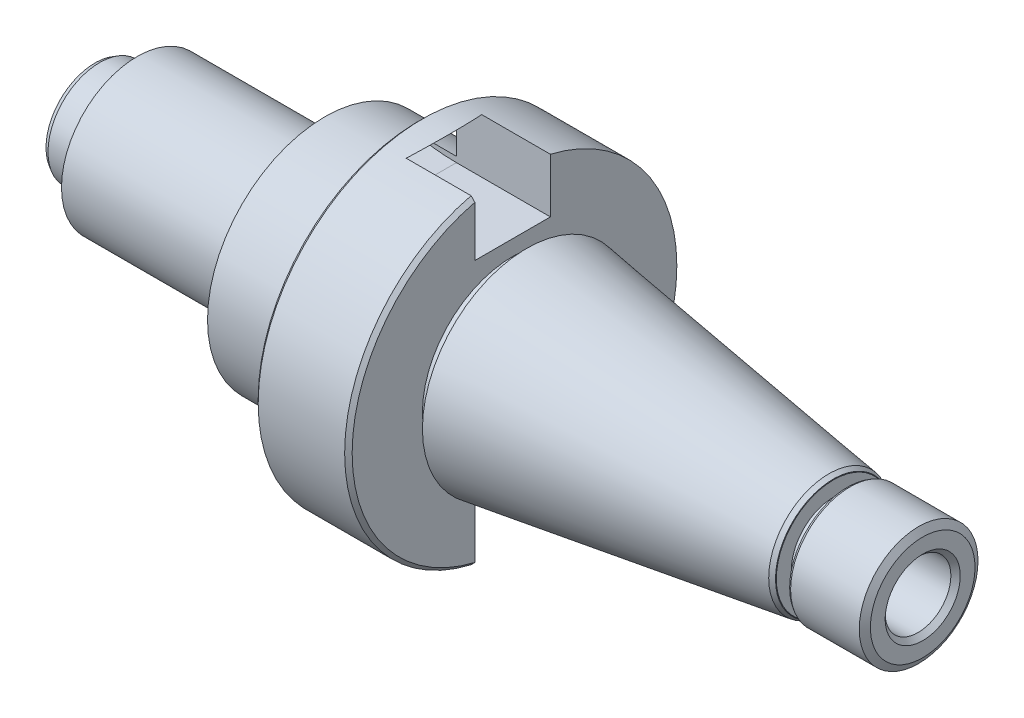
ISO-10303-21;
HEADER;
FILE_DESCRIPTION(('STEP AP214'),'2;1');
FILE_NAME('part.step','',(''),(''),'','','');
FILE_SCHEMA(('AUTOMOTIVE_DESIGN { 1 0 10303 214 1 1 1 1 }'));
ENDSEC;
DATA;
#1=APPLICATION_CONTEXT('core data for automotive mechanical design processes');
#2=APPLICATION_PROTOCOL_DEFINITION('international standard','automotive_design',2000,#1);
#3=PRODUCT_CONTEXT('',#1,'mechanical');
#4=PRODUCT('Part','Part','',(#3));
#5=PRODUCT_RELATED_PRODUCT_CATEGORY('part','',(#4));
#6=PRODUCT_DEFINITION_FORMATION('','',#4);
#7=PRODUCT_DEFINITION_CONTEXT('part definition',#1,'design');
#8=PRODUCT_DEFINITION('design','',#6,#7);
#9=PRODUCT_DEFINITION_SHAPE('','',#8);
#10=(LENGTH_UNIT() NAMED_UNIT(*) SI_UNIT(.MILLI.,.METRE.));
#11=(NAMED_UNIT(*) PLANE_ANGLE_UNIT() SI_UNIT($,.RADIAN.));
#12=(NAMED_UNIT(*) SI_UNIT($,.STERADIAN.) SOLID_ANGLE_UNIT());
#13=UNCERTAINTY_MEASURE_WITH_UNIT(LENGTH_MEASURE(1.E-05),#10,'distance_accuracy_value','');
#14=(GEOMETRIC_REPRESENTATION_CONTEXT(3) GLOBAL_UNCERTAINTY_ASSIGNED_CONTEXT((#13)) GLOBAL_UNIT_ASSIGNED_CONTEXT((#10,
#11,#12)) REPRESENTATION_CONTEXT('',''));
#15=CARTESIAN_POINT('',(0.,0.,0.));
#16=DIRECTION('',(0.,0.,1.));
#17=DIRECTION('',(1.,0.,0.));
#18=AXIS2_PLACEMENT_3D('',#15,#16,#17);
#19=CARTESIAN_POINT('',(-59.0241854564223,5.54189043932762,0.));
#20=DIRECTION('',(-1.,0.,0.));
#21=DIRECTION('',(0.,0.,1.));
#22=AXIS2_PLACEMENT_3D('',#19,#20,#21);
#23=PLANE('',#22);
#24=CARTESIAN_POINT('',(-59.0241854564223,0.,0.));
#25=DIRECTION('',(-1.,0.,0.));
#26=DIRECTION('',(0.,0.,1.));
#27=AXIS2_PLACEMENT_3D('',#24,#25,#26);
#28=CIRCLE('',#27,10.4226497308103);
#29=CARTESIAN_POINT('',(-59.0241854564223,0.,10.4226497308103));
#30=VERTEX_POINT('',#29);
#31=EDGE_CURVE('E292',#30,#30,#28,.T.);
#32=ORIENTED_EDGE('',*,*,#31,.T.);
#33=EDGE_LOOP('',(#32));
#34=FACE_BOUND('',#33,.T.);
#35=CARTESIAN_POINT('',(-59.0241854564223,0.,0.));
#36=DIRECTION('',(-1.,0.,0.));
#37=DIRECTION('',(0.,0.,1.));
#38=AXIS2_PLACEMENT_3D('',#35,#36,#37);
#39=CIRCLE('',#38,5.54189043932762);
#40=CARTESIAN_POINT('',(-59.0241854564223,0.,5.54189043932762));
#41=VERTEX_POINT('',#40);
#42=EDGE_CURVE('E234',#41,#41,#39,.T.);
#43=ORIENTED_EDGE('',*,*,#42,.F.);
#44=EDGE_LOOP('',(#43));
#45=FACE_BOUND('',#44,.T.);
#46=ADVANCED_FACE('F26',(#34,#45),#23,.T.);
#47=CARTESIAN_POINT('',(-30.,0.,0.));
#48=DIRECTION('',(-1.,0.,0.));
#49=DIRECTION('',(0.,0.,1.));
#50=AXIS2_PLACEMENT_3D('',#47,#48,#49);
#51=CYLINDRICAL_SURFACE('',#50,11.);
#52=CARTESIAN_POINT('',(-58.0241854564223,0.,0.));
#53=DIRECTION('',(-1.,0.,0.));
#54=DIRECTION('',(0.,0.,1.));
#55=AXIS2_PLACEMENT_3D('',#52,#53,#54);
#56=CIRCLE('',#55,11.);
#57=CARTESIAN_POINT('',(-58.0241854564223,0.,11.));
#58=VERTEX_POINT('',#57);
#59=EDGE_CURVE('E295',#58,#58,#56,.F.);
#60=ORIENTED_EDGE('',*,*,#59,.T.);
#61=EDGE_LOOP('',(#60));
#62=FACE_BOUND('',#61,.T.);
#63=CARTESIAN_POINT('',(-50.0241854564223,0.,0.));
#64=DIRECTION('',(-1.,0.,0.));
#65=DIRECTION('',(0.,0.,1.));
#66=AXIS2_PLACEMENT_3D('',#63,#64,#65);
#67=CIRCLE('',#66,11.);
#68=CARTESIAN_POINT('',(-50.0241854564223,0.,11.));
#69=VERTEX_POINT('',#68);
#70=EDGE_CURVE('E274',#69,#69,#67,.T.);
#71=ORIENTED_EDGE('',*,*,#70,.T.);
#72=EDGE_LOOP('',(#71));
#73=FACE_BOUND('',#72,.T.);
#74=ADVANCED_FACE('F379',(#62,#73),#51,.T.);
#75=CARTESIAN_POINT('',(-50.0241854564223,11.,0.));
#76=DIRECTION('',(-1.,0.,0.));
#77=DIRECTION('',(0.,0.,1.));
#78=AXIS2_PLACEMENT_3D('',#75,#76,#77);
#79=PLANE('',#78);
#80=CARTESIAN_POINT('',(-50.0241854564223,0.,0.));
#81=DIRECTION('',(-1.,0.,0.));
#82=DIRECTION('',(0.,0.,1.));
#83=AXIS2_PLACEMENT_3D('',#80,#81,#82);
#84=CIRCLE('',#83,16.1195276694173);
#85=CARTESIAN_POINT('',(-50.0241854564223,0.,16.1195276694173));
#86=VERTEX_POINT('',#85);
#87=EDGE_CURVE('E271',#86,#86,#84,.T.);
#88=ORIENTED_EDGE('',*,*,#87,.T.);
#89=EDGE_LOOP('',(#88));
#90=FACE_BOUND('',#89,.T.);
#91=ORIENTED_EDGE('',*,*,#70,.F.);
#92=EDGE_LOOP('',(#91));
#93=FACE_BOUND('',#92,.T.);
#94=ADVANCED_FACE('F385',(#90,#93),#79,.T.);
#95=CARTESIAN_POINT('',(-30.,0.,0.));
#96=DIRECTION('',(-1.,0.,0.));
#97=DIRECTION('',(0.,0.,1.));
#98=AXIS2_PLACEMENT_3D('',#95,#96,#97);
#99=CYLINDRICAL_SURFACE('',#98,16.1195276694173);
#100=ORIENTED_EDGE('',*,*,#87,.F.);
#101=EDGE_LOOP('',(#100));
#102=FACE_BOUND('',#101,.T.);
#103=CARTESIAN_POINT('',(-10.0241854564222,0.,0.));
#104=DIRECTION('',(-1.,0.,0.));
#105=DIRECTION('',(0.,0.,1.));
#106=AXIS2_PLACEMENT_3D('',#103,#104,#105);
#107=CIRCLE('',#106,16.1195276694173);
#108=CARTESIAN_POINT('',(-10.0241854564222,0.,16.1195276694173));
#109=VERTEX_POINT('',#108);
#110=EDGE_CURVE('E268',#109,#109,#107,.T.);
#111=ORIENTED_EDGE('',*,*,#110,.T.);
#112=EDGE_LOOP('',(#111));
#113=FACE_BOUND('',#112,.T.);
#114=ADVANCED_FACE('F464',(#102,#113),#99,.T.);
#115=CARTESIAN_POINT('',(-10.0241854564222,24.9999999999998,0.));
#116=DIRECTION('',(1.,0.,0.));
#117=DIRECTION('',(0.,0.,-1.));
#118=AXIS2_PLACEMENT_3D('',#115,#116,#117);
#119=PLANE('',#118);
#120=ORIENTED_EDGE('',*,*,#110,.F.);
#121=EDGE_LOOP('',(#120));
#122=FACE_BOUND('',#121,.T.);
#123=CARTESIAN_POINT('',(-10.0241854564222,0.,0.));
#124=DIRECTION('',(-1.,0.,0.));
#125=DIRECTION('',(0.,0.,1.));
#126=AXIS2_PLACEMENT_3D('',#123,#124,#125);
#127=CIRCLE('',#126,24.9999999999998);
#128=CARTESIAN_POINT('',(-10.0241854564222,0.,24.9999999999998));
#129=VERTEX_POINT('',#128);
#130=EDGE_CURVE('E265',#129,#129,#127,.T.);
#131=ORIENTED_EDGE('',*,*,#130,.T.);
#132=EDGE_LOOP('',(#131));
#133=FACE_BOUND('',#132,.T.);
#134=ADVANCED_FACE('F460',(#122,#133),#119,.F.);
#135=CARTESIAN_POINT('',(-30.,0.,0.));
#136=DIRECTION('',(-1.,0.,0.));
#137=DIRECTION('',(0.,0.,1.));
#138=AXIS2_PLACEMENT_3D('',#135,#136,#137);
#139=CYLINDRICAL_SURFACE('',#138,24.9999999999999);
#140=ORIENTED_EDGE('',*,*,#130,.F.);
#141=EDGE_LOOP('',(#140));
#142=FACE_BOUND('',#141,.T.);
#143=CARTESIAN_POINT('',(-24.6755664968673,0.,0.));
#144=DIRECTION('',(0.647903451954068,0.761722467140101,0.));
#145=DIRECTION('',(-0.761722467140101,0.647903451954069,0.));
#146=AXIS2_PLACEMENT_3D('',#143,#144,#145);
#147=ELLIPSE('',#146,38.5859959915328,24.9999999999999);
#148=CARTESIAN_POINT('',(3.15083548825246,-23.6684917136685,8.05000000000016));
#149=VERTEX_POINT('',#148);
#150=CARTESIAN_POINT('',(3.15083548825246,-23.6684917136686,-8.04999999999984));
#151=VERTEX_POINT('',#150);
#152=EDGE_CURVE('E187',#149,#151,#147,.T.);
#153=ORIENTED_EDGE('',*,*,#152,.F.);
#154=DIRECTION('',(-1.,0.,0.));
#155=VECTOR('',#154,1.);
#156=CARTESIAN_POINT('',(-30.,-23.6684917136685,8.05000000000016));
#157=LINE('',#156,#155);
#158=CARTESIAN_POINT('',(9.97581454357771,-23.6684917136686,8.05000000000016));
#159=VERTEX_POINT('',#158);
#160=EDGE_CURVE('E184',#149,#159,#157,.F.);
#161=ORIENTED_EDGE('',*,*,#160,.T.);
#162=CARTESIAN_POINT('',(9.97581454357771,0.,0.));
#163=DIRECTION('',(-1.,0.,0.));
#164=DIRECTION('',(0.,0.,1.));
#165=AXIS2_PLACEMENT_3D('',#162,#163,#164);
#166=CIRCLE('',#165,25.);
#167=CARTESIAN_POINT('',(9.97581454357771,23.6684917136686,8.05));
#168=VERTEX_POINT('',#167);
#169=EDGE_CURVE('E261',#159,#168,#166,.T.);
#170=ORIENTED_EDGE('',*,*,#169,.T.);
#171=DIRECTION('',(-1.,0.,0.));
#172=VECTOR('',#171,1.);
#173=CARTESIAN_POINT('',(-30.,23.6684917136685,8.05));
#174=LINE('',#173,#172);
#175=CARTESIAN_POINT('',(3.15083548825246,23.6684917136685,8.05));
#176=VERTEX_POINT('',#175);
#177=EDGE_CURVE('E219',#176,#168,#174,.F.);
#178=ORIENTED_EDGE('',*,*,#177,.F.);
#179=CARTESIAN_POINT('',(-24.6755664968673,0.,0.));
#180=DIRECTION('',(0.647903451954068,-0.761722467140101,0.));
#181=DIRECTION('',(-0.761722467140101,-0.647903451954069,0.));
#182=AXIS2_PLACEMENT_3D('',#179,#180,#181);
#183=ELLIPSE('',#182,38.5859959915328,24.9999999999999);
#184=CARTESIAN_POINT('',(3.15083548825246,23.6684917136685,-8.05));
#185=VERTEX_POINT('',#184);
#186=EDGE_CURVE('E232',#185,#176,#183,.T.);
#187=ORIENTED_EDGE('',*,*,#186,.F.);
#188=DIRECTION('',(-1.,0.,0.));
#189=VECTOR('',#188,1.);
#190=CARTESIAN_POINT('',(-30.,23.6684917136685,-8.05));
#191=LINE('',#190,#189);
#192=CARTESIAN_POINT('',(9.97581454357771,23.6684917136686,-8.05));
#193=VERTEX_POINT('',#192);
#194=EDGE_CURVE('E226',#185,#193,#191,.F.);
#195=ORIENTED_EDGE('',*,*,#194,.T.);
#196=CARTESIAN_POINT('',(9.97581454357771,-23.6684917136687,-8.04999999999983));
#197=VERTEX_POINT('',#196);
#198=EDGE_CURVE('E262',#193,#197,#166,.T.);
#199=ORIENTED_EDGE('',*,*,#198,.T.);
#200=DIRECTION('',(-1.,0.,0.));
#201=VECTOR('',#200,1.);
#202=CARTESIAN_POINT('',(-30.,-23.6684917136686,-8.04999999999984));
#203=LINE('',#202,#201);
#204=EDGE_CURVE('E159',#151,#197,#203,.F.);
#205=ORIENTED_EDGE('',*,*,#204,.F.);
#206=EDGE_LOOP('',(#153,#161,#170,#178,#187,#195,#199,#205));
#207=FACE_BOUND('',#206,.T.);
#208=ADVANCED_FACE('F456',(#142,#207),#139,.T.);
#209=CARTESIAN_POINT('',(9.97581454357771,25.,0.));
#210=DIRECTION('',(-1.,0.,0.));
#211=DIRECTION('',(0.,0.,1.));
#212=AXIS2_PLACEMENT_3D('',#209,#210,#211);
#213=PLANE('',#212);
#214=CARTESIAN_POINT('',(9.97581454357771,0.,0.));
#215=DIRECTION('',(-1.,0.,0.));
#216=DIRECTION('',(0.,0.,1.));
#217=AXIS2_PLACEMENT_3D('',#214,#215,#216);
#218=CIRCLE('',#217,34.2);
#219=CARTESIAN_POINT('',(9.97581454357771,0.,34.2));
#220=VERTEX_POINT('',#219);
#221=EDGE_CURVE('E313',#220,#220,#218,.T.);
#222=ORIENTED_EDGE('',*,*,#221,.T.);
#223=EDGE_LOOP('',(#222));
#224=FACE_BOUND('',#223,.T.);
#225=DIRECTION('',(0.,1.,0.));
#226=VECTOR('',#225,1.);
#227=CARTESIAN_POINT('',(9.97581454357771,-24.9999999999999,8.05000000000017));
#228=LINE('',#227,#226);
#229=CARTESIAN_POINT('',(9.97581454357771,-29.4736604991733,8.05000000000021));
#230=VERTEX_POINT('',#229);
#231=EDGE_CURVE('E175',#230,#159,#228,.T.);
#232=ORIENTED_EDGE('',*,*,#231,.F.);
#233=DIRECTION('',(0.,0.,-1.));
#234=VECTOR('',#233,1.);
#235=CARTESIAN_POINT('',(9.97581454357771,-29.4736604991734,2.05813590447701E-13));
#236=LINE('',#235,#234);
#237=CARTESIAN_POINT('',(9.97581454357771,-29.4736604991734,-8.04999999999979));
#238=VERTEX_POINT('',#237);
#239=EDGE_CURVE('E177',#230,#238,#236,.T.);
#240=ORIENTED_EDGE('',*,*,#239,.T.);
#241=DIRECTION('',(0.,1.,0.));
#242=VECTOR('',#241,1.);
#243=CARTESIAN_POINT('',(9.97581454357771,-25.,-8.04999999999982));
#244=LINE('',#243,#242);
#245=EDGE_CURVE('E509',#238,#197,#244,.T.);
#246=ORIENTED_EDGE('',*,*,#245,.T.);
#247=ORIENTED_EDGE('',*,*,#198,.F.);
#248=DIRECTION('',(0.,-1.,0.));
#249=VECTOR('',#248,1.);
#250=CARTESIAN_POINT('',(9.97581454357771,25.,-8.05));
#251=LINE('',#250,#249);
#252=CARTESIAN_POINT('',(9.97581454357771,29.4736604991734,-8.05));
#253=VERTEX_POINT('',#252);
#254=EDGE_CURVE('E224',#253,#193,#251,.T.);
#255=ORIENTED_EDGE('',*,*,#254,.F.);
#256=DIRECTION('',(0.,0.,1.));
#257=VECTOR('',#256,1.);
#258=CARTESIAN_POINT('',(9.97581454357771,29.4736604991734,0.));
#259=LINE('',#258,#257);
#260=CARTESIAN_POINT('',(9.97581454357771,29.4736604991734,8.05));
#261=VERTEX_POINT('',#260);
#262=EDGE_CURVE('E229',#253,#261,#259,.T.);
#263=ORIENTED_EDGE('',*,*,#262,.T.);
#264=DIRECTION('',(0.,-1.,0.));
#265=VECTOR('',#264,1.);
#266=CARTESIAN_POINT('',(9.97581454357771,25.,8.05));
#267=LINE('',#266,#265);
#268=EDGE_CURVE('E216',#261,#168,#267,.T.);
#269=ORIENTED_EDGE('',*,*,#268,.T.);
#270=ORIENTED_EDGE('',*,*,#169,.F.);
#271=EDGE_LOOP('',(#232,#240,#246,#247,#255,#263,#269,#270));
#272=FACE_BOUND('',#271,.T.);
#273=ADVANCED_FACE('F453',(#224,#272),#213,.T.);
#274=CARTESIAN_POINT('',(-30.,0.,0.));
#275=DIRECTION('',(-1.,0.,0.));
#276=DIRECTION('',(0.,0.,1.));
#277=AXIS2_PLACEMENT_3D('',#274,#275,#276);
#278=CYLINDRICAL_SURFACE('',#277,35.);
#279=CARTESIAN_POINT('',(10.7758145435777,0.,0.));
#280=DIRECTION('',(-1.,0.,0.));
#281=DIRECTION('',(0.,0.,1.));
#282=AXIS2_PLACEMENT_3D('',#279,#280,#281);
#283=CIRCLE('',#282,35.);
#284=CARTESIAN_POINT('',(10.7758145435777,0.,35.));
#285=VERTEX_POINT('',#284);
#286=EDGE_CURVE('E319',#285,#285,#283,.F.);
#287=ORIENTED_EDGE('',*,*,#286,.T.);
#288=EDGE_LOOP('',(#287));
#289=FACE_BOUND('',#288,.T.);
#290=DIRECTION('',(-1.,0.,0.));
#291=VECTOR('',#290,1.);
#292=CARTESIAN_POINT('',(-30.,-34.0616720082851,8.05000000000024));
#293=LINE('',#292,#291);
#294=CARTESIAN_POINT('',(29.2,-34.0616720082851,8.05000000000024));
#295=VERTEX_POINT('',#294);
#296=CARTESIAN_POINT('',(15.3698148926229,-34.0616720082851,8.05000000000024));
#297=VERTEX_POINT('',#296);
#298=EDGE_CURVE('E172',#295,#297,#293,.T.);
#299=ORIENTED_EDGE('',*,*,#298,.F.);
#300=CARTESIAN_POINT('',(29.2,0.,0.));
#301=DIRECTION('',(1.,0.,0.));
#302=DIRECTION('',(0.,0.,-1.));
#303=AXIS2_PLACEMENT_3D('',#300,#301,#302);
#304=CIRCLE('',#303,35.);
#305=CARTESIAN_POINT('',(29.2,34.0616720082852,8.05));
#306=VERTEX_POINT('',#305);
#307=EDGE_CURVE('E316',#295,#306,#304,.F.);
#308=ORIENTED_EDGE('',*,*,#307,.T.);
#309=DIRECTION('',(-1.,0.,0.));
#310=VECTOR('',#309,1.);
#311=CARTESIAN_POINT('',(-30.,34.0616720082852,8.05));
#312=LINE('',#311,#310);
#313=CARTESIAN_POINT('',(15.3698148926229,34.0616720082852,8.05));
#314=VERTEX_POINT('',#313);
#315=EDGE_CURVE('E214',#306,#314,#312,.T.);
#316=ORIENTED_EDGE('',*,*,#315,.T.);
#317=CARTESIAN_POINT('',(-24.6755664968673,0.,0.));
#318=DIRECTION('',(0.647903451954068,-0.761722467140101,0.));
#319=DIRECTION('',(-0.761722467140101,-0.647903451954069,0.));
#320=AXIS2_PLACEMENT_3D('',#317,#318,#319);
#321=ELLIPSE('',#320,54.020394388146,35.);
#322=CARTESIAN_POINT('',(15.3698148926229,34.0616720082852,-8.05));
#323=VERTEX_POINT('',#322);
#324=EDGE_CURVE('E304',#314,#323,#321,.F.);
#325=ORIENTED_EDGE('',*,*,#324,.T.);
#326=DIRECTION('',(-1.,0.,0.));
#327=VECTOR('',#326,1.);
#328=CARTESIAN_POINT('',(-30.,34.0616720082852,-8.05));
#329=LINE('',#328,#327);
#330=CARTESIAN_POINT('',(30.,34.0616720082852,-8.05));
#331=VERTEX_POINT('',#330);
#332=EDGE_CURVE('E222',#331,#323,#329,.T.);
#333=ORIENTED_EDGE('',*,*,#332,.F.);
#334=CARTESIAN_POINT('',(30.,0.,0.));
#335=DIRECTION('',(-1.,0.,0.));
#336=DIRECTION('',(0.,0.,1.));
#337=AXIS2_PLACEMENT_3D('',#334,#335,#336);
#338=CIRCLE('',#337,35.);
#339=CARTESIAN_POINT('',(30.,-34.0616720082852,-8.04999999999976));
#340=VERTEX_POINT('',#339);
#341=EDGE_CURVE('E258',#331,#340,#338,.T.);
#342=ORIENTED_EDGE('',*,*,#341,.T.);
#343=DIRECTION('',(-1.,0.,0.));
#344=VECTOR('',#343,1.);
#345=CARTESIAN_POINT('',(-30.,-34.0616720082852,-8.04999999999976));
#346=LINE('',#345,#344);
#347=CARTESIAN_POINT('',(15.3698148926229,-34.0616720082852,-8.04999999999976));
#348=VERTEX_POINT('',#347);
#349=EDGE_CURVE('E514',#340,#348,#346,.T.);
#350=ORIENTED_EDGE('',*,*,#349,.T.);
#351=CARTESIAN_POINT('',(-24.6755664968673,0.,0.));
#352=DIRECTION('',(0.647903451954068,0.761722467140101,0.));
#353=DIRECTION('',(-0.761722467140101,0.647903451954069,0.));
#354=AXIS2_PLACEMENT_3D('',#351,#352,#353);
#355=ELLIPSE('',#354,54.020394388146,35.);
#356=EDGE_CURVE('E523',#348,#297,#355,.F.);
#357=ORIENTED_EDGE('',*,*,#356,.T.);
#358=EDGE_LOOP('',(#299,#308,#316,#325,#333,#342,#350,#357));
#359=FACE_BOUND('',#358,.T.);
#360=ADVANCED_FACE('F450',(#289,#359),#278,.T.);
#361=CARTESIAN_POINT('',(30.,35.,0.));
#362=DIRECTION('',(1.,0.,0.));
#363=DIRECTION('',(0.,0.,-1.));
#364=AXIS2_PLACEMENT_3D('',#361,#362,#363);
#365=PLANE('',#364);
#366=DIRECTION('',(0.,1.,0.));
#367=VECTOR('',#366,1.);
#368=CARTESIAN_POINT('',(30.,35.,8.05));
#369=LINE('',#368,#367);
#370=CARTESIAN_POINT('',(30.,22.5,8.05));
#371=VERTEX_POINT('',#370);
#372=CARTESIAN_POINT('',(30.,33.2390959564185,8.05));
#373=VERTEX_POINT('',#372);
#374=EDGE_CURVE('E298',#371,#373,#369,.T.);
#375=ORIENTED_EDGE('',*,*,#374,.T.);
#376=CARTESIAN_POINT('',(30.,0.,0.));
#377=DIRECTION('',(1.,0.,0.));
#378=DIRECTION('',(0.,0.,-1.));
#379=AXIS2_PLACEMENT_3D('',#376,#377,#378);
#380=CIRCLE('',#379,34.2);
#381=CARTESIAN_POINT('',(30.,-33.2390959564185,8.05000000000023));
#382=VERTEX_POINT('',#381);
#383=EDGE_CURVE('E40',#373,#382,#380,.T.);
#384=ORIENTED_EDGE('',*,*,#383,.T.);
#385=DIRECTION('',(0.,-1.,0.));
#386=VECTOR('',#385,1.);
#387=CARTESIAN_POINT('',(30.,-34.9999999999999,8.05000000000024));
#388=LINE('',#387,#386);
#389=CARTESIAN_POINT('',(30.,-22.4999999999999,8.05000000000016));
#390=VERTEX_POINT('',#389);
#391=EDGE_CURVE('E164',#390,#382,#388,.T.);
#392=ORIENTED_EDGE('',*,*,#391,.F.);
#393=DIRECTION('',(0.,0.,1.));
#394=VECTOR('',#393,1.);
#395=CARTESIAN_POINT('',(30.,-22.5,1.57116751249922E-13));
#396=LINE('',#395,#394);
#397=CARTESIAN_POINT('',(30.,-22.5000000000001,-8.04999999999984));
#398=VERTEX_POINT('',#397);
#399=EDGE_CURVE('E151',#398,#390,#396,.T.);
#400=ORIENTED_EDGE('',*,*,#399,.F.);
#401=DIRECTION('',(0.,-1.,0.));
#402=VECTOR('',#401,1.);
#403=CARTESIAN_POINT('',(30.,-35.,-8.04999999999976));
#404=LINE('',#403,#402);
#405=EDGE_CURVE('E522',#398,#340,#404,.T.);
#406=ORIENTED_EDGE('',*,*,#405,.T.);
#407=ORIENTED_EDGE('',*,*,#341,.F.);
#408=DIRECTION('',(0.,1.,0.));
#409=VECTOR('',#408,1.);
#410=CARTESIAN_POINT('',(30.,35.,-8.05));
#411=LINE('',#410,#409);
#412=CARTESIAN_POINT('',(30.,22.5,-8.05));
#413=VERTEX_POINT('',#412);
#414=EDGE_CURVE('E302',#413,#331,#411,.T.);
#415=ORIENTED_EDGE('',*,*,#414,.F.);
#416=DIRECTION('',(0.,0.,-1.));
#417=VECTOR('',#416,1.);
#418=CARTESIAN_POINT('',(30.,22.5,0.));
#419=LINE('',#418,#417);
#420=EDGE_CURVE('E300',#371,#413,#419,.T.);
#421=ORIENTED_EDGE('',*,*,#420,.F.);
#422=EDGE_LOOP('',(#375,#384,#392,#400,#406,#407,#415,#421));
#423=FACE_BOUND('',#422,.T.);
#424=CARTESIAN_POINT('',(30.,0.,0.));
#425=DIRECTION('',(-1.,0.,0.));
#426=DIRECTION('',(0.,0.,1.));
#427=AXIS2_PLACEMENT_3D('',#424,#425,#426);
#428=CIRCLE('',#427,19.225);
#429=CARTESIAN_POINT('',(30.,0.,19.225));
#430=VERTEX_POINT('',#429);
#431=EDGE_CURVE('E255',#430,#430,#428,.T.);
#432=ORIENTED_EDGE('',*,*,#431,.T.);
#433=EDGE_LOOP('',(#432));
#434=FACE_BOUND('',#433,.T.);
#435=ADVANCED_FACE('F170',(#423,#434),#365,.T.);
#436=CARTESIAN_POINT('',(-30.,0.,0.));
#437=DIRECTION('',(-1.,0.,0.));
#438=DIRECTION('',(0.,0.,1.));
#439=AXIS2_PLACEMENT_3D('',#436,#437,#438);
#440=CYLINDRICAL_SURFACE('',#439,19.225);
#441=ORIENTED_EDGE('',*,*,#431,.F.);
#442=EDGE_LOOP('',(#441));
#443=FACE_BOUND('',#442,.T.);
#444=CARTESIAN_POINT('',(33.,0.,0.));
#445=DIRECTION('',(-1.,0.,0.));
#446=DIRECTION('',(0.,0.,1.));
#447=AXIS2_PLACEMENT_3D('',#444,#445,#446);
#448=CIRCLE('',#447,19.225);
#449=CARTESIAN_POINT('',(33.,0.,19.225));
#450=VERTEX_POINT('',#449);
#451=EDGE_CURVE('E252',#450,#450,#448,.T.);
#452=ORIENTED_EDGE('',*,*,#451,.T.);
#453=EDGE_LOOP('',(#452));
#454=FACE_BOUND('',#453,.T.);
#455=ADVANCED_FACE('F443',(#443,#454),#440,.T.);
#456=CARTESIAN_POINT('',(33.,22.225,0.));
#457=DIRECTION('',(1.,0.,0.));
#458=DIRECTION('',(0.,0.,-1.));
#459=AXIS2_PLACEMENT_3D('',#456,#457,#458);
#460=PLANE('',#459);
#461=ORIENTED_EDGE('',*,*,#451,.F.);
#462=EDGE_LOOP('',(#461));
#463=FACE_BOUND('',#462,.T.);
#464=CARTESIAN_POINT('',(33.,0.,0.));
#465=DIRECTION('',(-1.,0.,0.));
#466=DIRECTION('',(0.,0.,1.));
#467=AXIS2_PLACEMENT_3D('',#464,#465,#466);
#468=CIRCLE('',#467,22.225);
#469=CARTESIAN_POINT('',(33.,0.,22.225));
#470=VERTEX_POINT('',#469);
#471=EDGE_CURVE('E249',#470,#470,#468,.T.);
#472=ORIENTED_EDGE('',*,*,#471,.T.);
#473=EDGE_LOOP('',(#472));
#474=FACE_BOUND('',#473,.T.);
#475=ADVANCED_FACE('F439',(#463,#474),#460,.F.);
#476=CARTESIAN_POINT('',(33.,0.,0.));
#477=DIRECTION('',(-1.,0.,0.));
#478=DIRECTION('',(0.,0.,1.));
#479=AXIS2_PLACEMENT_3D('',#476,#477,#478);
#480=CONICAL_SURFACE('',#479,22.225,0.144687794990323);
#481=CARTESIAN_POINT('',(97.4160298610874,0.,0.));
#482=DIRECTION('',(1.,0.,0.));
#483=DIRECTION('',(0.,0.,-1.));
#484=AXIS2_PLACEMENT_3D('',#481,#482,#483);
#485=CIRCLE('',#484,12.8391992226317);
#486=CARTESIAN_POINT('',(97.4160298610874,0.,12.8391992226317));
#487=VERTEX_POINT('',#486);
#488=EDGE_CURVE('E307',#487,#487,#485,.F.);
#489=ORIENTED_EDGE('',*,*,#488,.T.);
#490=EDGE_LOOP('',(#489));
#491=FACE_BOUND('',#490,.T.);
#492=ORIENTED_EDGE('',*,*,#471,.F.);
#493=EDGE_LOOP('',(#492));
#494=FACE_BOUND('',#493,.T.);
#495=ADVANCED_FACE('F435',(#491,#494),#480,.T.);
#496=CARTESIAN_POINT('',(98.4,12.6958288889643,0.));
#497=DIRECTION('',(1.,0.,0.));
#498=DIRECTION('',(0.,0.,-1.));
#499=AXIS2_PLACEMENT_3D('',#496,#497,#498);
#500=PLANE('',#499);
#501=CARTESIAN_POINT('',(98.4,0.,0.));
#502=DIRECTION('',(1.,0.,0.));
#503=DIRECTION('',(0.,0.,-1.));
#504=AXIS2_PLACEMENT_3D('',#501,#502,#503);
#505=CIRCLE('',#504,12.1958288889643);
#506=CARTESIAN_POINT('',(98.4,0.,-12.1958288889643));
#507=VERTEX_POINT('',#506);
#508=EDGE_CURVE('E289',#507,#507,#505,.T.);
#509=ORIENTED_EDGE('',*,*,#508,.T.);
#510=EDGE_LOOP('',(#509));
#511=FACE_BOUND('',#510,.T.);
#512=CARTESIAN_POINT('',(98.4,0.,0.));
#513=DIRECTION('',(-1.,0.,0.));
#514=DIRECTION('',(0.,0.,1.));
#515=AXIS2_PLACEMENT_3D('',#512,#513,#514);
#516=CIRCLE('',#515,8.99999999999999);
#517=CARTESIAN_POINT('',(98.4,0.,8.99999999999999));
#518=VERTEX_POINT('',#517);
#519=EDGE_CURVE('E246',#518,#518,#516,.T.);
#520=ORIENTED_EDGE('',*,*,#519,.T.);
#521=EDGE_LOOP('',(#520));
#522=FACE_BOUND('',#521,.T.);
#523=ADVANCED_FACE('F432',(#511,#522),#500,.T.);
#524=CARTESIAN_POINT('',(-30.,0.,0.));
#525=DIRECTION('',(-1.,0.,0.));
#526=DIRECTION('',(0.,0.,1.));
#527=AXIS2_PLACEMENT_3D('',#524,#525,#526);
#528=CYLINDRICAL_SURFACE('',#527,8.99999999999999);
#529=CARTESIAN_POINT('',(101.4,0.,0.));
#530=DIRECTION('',(-1.,0.,0.));
#531=DIRECTION('',(0.,0.,1.));
#532=AXIS2_PLACEMENT_3D('',#529,#530,#531);
#533=CIRCLE('',#532,8.99999999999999);
#534=CARTESIAN_POINT('',(101.4,0.,8.99999999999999));
#535=VERTEX_POINT('',#534);
#536=EDGE_CURVE('E243',#535,#535,#533,.T.);
#537=ORIENTED_EDGE('',*,*,#536,.T.);
#538=EDGE_LOOP('',(#537));
#539=FACE_BOUND('',#538,.T.);
#540=ORIENTED_EDGE('',*,*,#519,.F.);
#541=EDGE_LOOP('',(#540));
#542=FACE_BOUND('',#541,.T.);
#543=ADVANCED_FACE('F428',(#539,#542),#528,.T.);
#544=CARTESIAN_POINT('',(101.4,8.99999999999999,0.));
#545=DIRECTION('',(-1.,0.,0.));
#546=DIRECTION('',(0.,0.,1.));
#547=AXIS2_PLACEMENT_3D('',#544,#545,#546);
#548=PLANE('',#547);
#549=CARTESIAN_POINT('',(101.4,0.,0.));
#550=DIRECTION('',(-1.,0.,0.));
#551=DIRECTION('',(0.,0.,1.));
#552=AXIS2_PLACEMENT_3D('',#549,#550,#551);
#553=CIRCLE('',#552,12.3613248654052);
#554=CARTESIAN_POINT('',(101.4,0.,12.3613248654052));
#555=VERTEX_POINT('',#554);
#556=EDGE_CURVE('E283',#555,#555,#553,.T.);
#557=ORIENTED_EDGE('',*,*,#556,.T.);
#558=EDGE_LOOP('',(#557));
#559=FACE_BOUND('',#558,.T.);
#560=ORIENTED_EDGE('',*,*,#536,.F.);
#561=EDGE_LOOP('',(#560));
#562=FACE_BOUND('',#561,.T.);
#563=ADVANCED_FACE('F424',(#559,#562),#548,.T.);
#564=CARTESIAN_POINT('',(-30.,0.,0.));
#565=DIRECTION('',(-1.,0.,0.));
#566=DIRECTION('',(0.,0.,1.));
#567=AXIS2_PLACEMENT_3D('',#564,#565,#566);
#568=CYLINDRICAL_SURFACE('',#567,12.65);
#569=CARTESIAN_POINT('',(101.9,0.,0.));
#570=DIRECTION('',(-1.,0.,0.));
#571=DIRECTION('',(0.,0.,1.));
#572=AXIS2_PLACEMENT_3D('',#569,#570,#571);
#573=CIRCLE('',#572,12.65);
#574=CARTESIAN_POINT('',(101.9,0.,12.65));
#575=VERTEX_POINT('',#574);
#576=EDGE_CURVE('E286',#575,#575,#573,.F.);
#577=ORIENTED_EDGE('',*,*,#576,.T.);
#578=EDGE_LOOP('',(#577));
#579=FACE_BOUND('',#578,.T.);
#580=CARTESIAN_POINT('',(116.533974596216,0.,0.));
#581=DIRECTION('',(1.,0.,0.));
#582=DIRECTION('',(0.,0.,-1.));
#583=AXIS2_PLACEMENT_3D('',#580,#581,#582);
#584=CIRCLE('',#583,12.65);
#585=CARTESIAN_POINT('',(116.533974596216,0.,-12.65));
#586=VERTEX_POINT('',#585);
#587=EDGE_CURVE('E277',#586,#586,#584,.F.);
#588=ORIENTED_EDGE('',*,*,#587,.T.);
#589=EDGE_LOOP('',(#588));
#590=FACE_BOUND('',#589,.T.);
#591=ADVANCED_FACE('F420',(#579,#590),#568,.T.);
#592=CARTESIAN_POINT('',(117.4,12.65,0.));
#593=DIRECTION('',(1.,0.,0.));
#594=DIRECTION('',(0.,0.,-1.));
#595=AXIS2_PLACEMENT_3D('',#592,#593,#594);
#596=PLANE('',#595);
#597=CARTESIAN_POINT('',(117.4,0.,0.));
#598=DIRECTION('',(1.,0.,0.));
#599=DIRECTION('',(0.,0.,-1.));
#600=AXIS2_PLACEMENT_3D('',#597,#598,#599);
#601=CIRCLE('',#600,8.00000000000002);
#602=CARTESIAN_POINT('',(117.4,0.,-8.00000000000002));
#603=VERTEX_POINT('',#602);
#604=EDGE_CURVE('E33',#603,#603,#601,.F.);
#605=ORIENTED_EDGE('',*,*,#604,.T.);
#606=EDGE_LOOP('',(#605));
#607=FACE_BOUND('',#606,.T.);
#608=CARTESIAN_POINT('',(117.4,0.,0.));
#609=DIRECTION('',(1.,0.,0.));
#610=DIRECTION('',(0.,0.,-1.));
#611=AXIS2_PLACEMENT_3D('',#608,#609,#610);
#612=CIRCLE('',#611,11.15);
#613=CARTESIAN_POINT('',(117.4,0.,-11.15));
#614=VERTEX_POINT('',#613);
#615=EDGE_CURVE('E280',#614,#614,#612,.T.);
#616=ORIENTED_EDGE('',*,*,#615,.T.);
#617=EDGE_LOOP('',(#616));
#618=FACE_BOUND('',#617,.T.);
#619=ADVANCED_FACE('F416',(#607,#618),#596,.T.);
#620=CARTESIAN_POINT('',(-30.,0.,0.));
#621=DIRECTION('',(-1.,0.,0.));
#622=DIRECTION('',(0.,0.,1.));
#623=AXIS2_PLACEMENT_3D('',#620,#621,#622);
#624=CYLINDRICAL_SURFACE('',#623,6.99999999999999);
#625=CARTESIAN_POINT('',(116.4,0.,0.));
#626=DIRECTION('',(1.,0.,0.));
#627=DIRECTION('',(0.,0.,-1.));
#628=AXIS2_PLACEMENT_3D('',#625,#626,#627);
#629=CIRCLE('',#628,6.99999999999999);
#630=CARTESIAN_POINT('',(116.4,0.,-6.99999999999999));
#631=VERTEX_POINT('',#630);
#632=EDGE_CURVE('E11',#631,#631,#629,.T.);
#633=ORIENTED_EDGE('',*,*,#632,.T.);
#634=EDGE_LOOP('',(#633));
#635=FACE_BOUND('',#634,.T.);
#636=CARTESIAN_POINT('',(59.0414518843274,0.,0.));
#637=DIRECTION('',(-1.,0.,0.));
#638=DIRECTION('',(0.,0.,1.));
#639=AXIS2_PLACEMENT_3D('',#636,#637,#638);
#640=CIRCLE('',#639,6.99999999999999);
#641=CARTESIAN_POINT('',(59.0414518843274,0.,6.99999999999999));
#642=VERTEX_POINT('',#641);
#643=EDGE_CURVE('E240',#642,#642,#640,.T.);
#644=ORIENTED_EDGE('',*,*,#643,.T.);
#645=EDGE_LOOP('',(#644));
#646=FACE_BOUND('',#645,.T.);
#647=ADVANCED_FACE('F412',(#635,#646),#624,.F.);
#648=CARTESIAN_POINT('',(59.0414518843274,0.,0.));
#649=DIRECTION('',(1.,0.,0.));
#650=DIRECTION('',(0.,0.,-1.));
#651=AXIS2_PLACEMENT_3D('',#648,#649,#650);
#652=CONICAL_SURFACE('',#651,6.99999999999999,1.0471975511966);
#653=CARTESIAN_POINT('',(55.,0.,0.));
#654=VERTEX_POINT('',#653);
#655=VERTEX_LOOP('',#654);
#656=FACE_BOUND('',#655,.T.);
#657=ORIENTED_EDGE('',*,*,#643,.F.);
#658=EDGE_LOOP('',(#657));
#659=FACE_BOUND('',#658,.T.);
#660=ADVANCED_FACE('F404',(#656,#659),#652,.F.);
#661=CARTESIAN_POINT('',(20.9758145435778,0.,0.));
#662=DIRECTION('',(-1.,0.,0.));
#663=DIRECTION('',(0.,0.,1.));
#664=AXIS2_PLACEMENT_3D('',#661,#662,#663);
#665=CONICAL_SURFACE('',#664,5.54189043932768,1.04719755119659);
#666=CARTESIAN_POINT('',(24.1754264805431,0.,0.));
#667=VERTEX_POINT('',#666);
#668=VERTEX_LOOP('',#667);
#669=FACE_BOUND('',#668,.T.);
#670=CARTESIAN_POINT('',(20.9758145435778,0.,0.));
#671=DIRECTION('',(-1.,0.,0.));
#672=DIRECTION('',(0.,0.,1.));
#673=AXIS2_PLACEMENT_3D('',#670,#671,#672);
#674=CIRCLE('',#673,5.54189043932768);
#675=CARTESIAN_POINT('',(20.9758145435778,0.,5.54189043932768));
#676=VERTEX_POINT('',#675);
#677=EDGE_CURVE('E237',#676,#676,#674,.T.);
#678=ORIENTED_EDGE('',*,*,#677,.T.);
#679=EDGE_LOOP('',(#678));
#680=FACE_BOUND('',#679,.T.);
#681=ADVANCED_FACE('F394',(#669,#680),#665,.F.);
#682=CARTESIAN_POINT('',(-30.,0.,0.));
#683=DIRECTION('',(-1.,0.,0.));
#684=DIRECTION('',(0.,0.,1.));
#685=AXIS2_PLACEMENT_3D('',#682,#683,#684);
#686=CYLINDRICAL_SURFACE('',#685,5.54189043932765);
#687=ORIENTED_EDGE('',*,*,#677,.F.);
#688=EDGE_LOOP('',(#687));
#689=FACE_BOUND('',#688,.T.);
#690=ORIENTED_EDGE('',*,*,#42,.T.);
#691=EDGE_LOOP('',(#690));
#692=FACE_BOUND('',#691,.T.);
#693=ADVANCED_FACE('F391',(#689,#692),#686,.F.);
#694=CARTESIAN_POINT('',(116.533974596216,0.,0.));
#695=DIRECTION('',(-1.,0.,0.));
#696=DIRECTION('',(0.,0.,1.));
#697=AXIS2_PLACEMENT_3D('',#694,#695,#696);
#698=CONICAL_SURFACE('',#697,12.65,1.0471975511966);
#699=ORIENTED_EDGE('',*,*,#615,.F.);
#700=EDGE_LOOP('',(#699));
#701=FACE_BOUND('',#700,.T.);
#702=ORIENTED_EDGE('',*,*,#587,.F.);
#703=EDGE_LOOP('',(#702));
#704=FACE_BOUND('',#703,.T.);
#705=ADVANCED_FACE('F393',(#701,#704),#698,.T.);
#706=CARTESIAN_POINT('',(101.4,0.,0.));
#707=DIRECTION('',(1.,0.,0.));
#708=DIRECTION('',(0.,0.,-1.));
#709=AXIS2_PLACEMENT_3D('',#706,#707,#708);
#710=CONICAL_SURFACE('',#709,12.3613248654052,0.523598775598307);
#711=ORIENTED_EDGE('',*,*,#576,.F.);
#712=EDGE_LOOP('',(#711));
#713=FACE_BOUND('',#712,.T.);
#714=ORIENTED_EDGE('',*,*,#556,.F.);
#715=EDGE_LOOP('',(#714));
#716=FACE_BOUND('',#715,.T.);
#717=ADVANCED_FACE('F401',(#713,#716),#710,.T.);
#718=CARTESIAN_POINT('',(98.084810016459,0.,0.));
#719=DIRECTION('',(-1.,0.,0.));
#720=DIRECTION('',(0.,0.,1.));
#721=AXIS2_PLACEMENT_3D('',#718,#719,#720);
#722=CONICAL_SURFACE('',#721,12.741753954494,1.04719755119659);
#723=CARTESIAN_POINT('',(98.334810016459,0.,0.));
#724=DIRECTION('',(1.,0.,0.));
#725=DIRECTION('',(0.,0.,-1.));
#726=AXIS2_PLACEMENT_3D('',#723,#724,#725);
#727=CIRCLE('',#726,12.3087412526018);
#728=CARTESIAN_POINT('',(98.334810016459,0.,12.3087412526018));
#729=VERTEX_POINT('',#728);
#730=EDGE_CURVE('E310',#729,#729,#727,.T.);
#731=ORIENTED_EDGE('',*,*,#730,.T.);
#732=EDGE_LOOP('',(#731));
#733=FACE_BOUND('',#732,.T.);
#734=ORIENTED_EDGE('',*,*,#508,.F.);
#735=EDGE_LOOP('',(#734));
#736=FACE_BOUND('',#735,.T.);
#737=ADVANCED_FACE('F555',(#733,#736),#722,.T.);
#738=CARTESIAN_POINT('',(-59.0241854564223,0.,0.));
#739=DIRECTION('',(1.,0.,0.));
#740=DIRECTION('',(0.,0.,-1.));
#741=AXIS2_PLACEMENT_3D('',#738,#739,#740);
#742=CONICAL_SURFACE('',#741,10.4226497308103,0.523598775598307);
#743=ORIENTED_EDGE('',*,*,#59,.F.);
#744=EDGE_LOOP('',(#743));
#745=FACE_BOUND('',#744,.T.);
#746=ORIENTED_EDGE('',*,*,#31,.F.);
#747=EDGE_LOOP('',(#746));
#748=FACE_BOUND('',#747,.T.);
#749=ADVANCED_FACE('F550',(#745,#748),#742,.T.);
#750=CARTESIAN_POINT('',(2.58646928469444,23.1884549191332,-8.05));
#751=DIRECTION('',(0.647903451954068,-0.761722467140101,0.));
#752=DIRECTION('',(0.761722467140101,0.647903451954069,0.));
#753=AXIS2_PLACEMENT_3D('',#750,#751,#752);
#754=PLANE('',#753);
#755=ORIENTED_EDGE('',*,*,#186,.T.);
#756=DIRECTION('',(0.761722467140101,0.647903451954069,0.));
#757=VECTOR('',#756,1.);
#758=CARTESIAN_POINT('',(2.58646928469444,23.1884549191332,8.05));
#759=LINE('',#758,#757);
#760=CARTESIAN_POINT('',(2.58646928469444,23.1884549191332,8.05));
#761=VERTEX_POINT('',#760);
#762=EDGE_CURVE('E194',#761,#176,#759,.T.);
#763=ORIENTED_EDGE('',*,*,#762,.F.);
#764=DIRECTION('',(0.,0.,1.));
#765=VECTOR('',#764,1.);
#766=CARTESIAN_POINT('',(2.58646928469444,23.1884549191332,-8.05));
#767=LINE('',#766,#765);
#768=CARTESIAN_POINT('',(2.58646928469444,23.1884549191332,-8.05));
#769=VERTEX_POINT('',#768);
#770=EDGE_CURVE('E212',#769,#761,#767,.T.);
#771=ORIENTED_EDGE('',*,*,#770,.F.);
#772=DIRECTION('',(0.761722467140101,0.647903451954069,0.));
#773=VECTOR('',#772,1.);
#774=CARTESIAN_POINT('',(2.58646928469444,23.1884549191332,-8.05));
#775=LINE('',#774,#773);
#776=EDGE_CURVE('E204',#769,#185,#775,.T.);
#777=ORIENTED_EDGE('',*,*,#776,.T.);
#778=EDGE_LOOP('',(#755,#763,#771,#777));
#779=FACE_BOUND('',#778,.T.);
#780=ADVANCED_FACE('F505',(#779),#754,.T.);
#781=CARTESIAN_POINT('',(9.97581454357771,62.5,-8.05));
#782=DIRECTION('',(0.,0.,-1.));
#783=DIRECTION('',(-1.,0.,0.));
#784=AXIS2_PLACEMENT_3D('',#781,#782,#783);
#785=PLANE('',#784);
#786=ORIENTED_EDGE('',*,*,#776,.F.);
#787=CARTESIAN_POINT('',(9.97581454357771,62.5,-8.05));
#788=DIRECTION('',(0.,0.,-1.));
#789=DIRECTION('',(-1.,0.,0.));
#790=AXIS2_PLACEMENT_3D('',#787,#788,#789);
#791=CIRCLE('',#790,40.);
#792=CARTESIAN_POINT('',(9.97581454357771,22.5,-8.05));
#793=VERTEX_POINT('',#792);
#794=EDGE_CURVE('E200',#793,#769,#791,.T.);
#795=ORIENTED_EDGE('',*,*,#794,.F.);
#796=DIRECTION('',(1.,0.,0.));
#797=VECTOR('',#796,1.);
#798=CARTESIAN_POINT('',(9.97581454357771,22.5,-8.05));
#799=LINE('',#798,#797);
#800=EDGE_CURVE('E207',#793,#413,#799,.T.);
#801=ORIENTED_EDGE('',*,*,#800,.T.);
#802=ORIENTED_EDGE('',*,*,#414,.T.);
#803=ORIENTED_EDGE('',*,*,#332,.T.);
#804=EDGE_CURVE('E203',#253,#323,#775,.T.);
#805=ORIENTED_EDGE('',*,*,#804,.F.);
#806=ORIENTED_EDGE('',*,*,#254,.T.);
#807=ORIENTED_EDGE('',*,*,#194,.F.);
#808=EDGE_LOOP('',(#786,#795,#801,#802,#803,#805,#806,#807));
#809=FACE_BOUND('',#808,.T.);
#810=ADVANCED_FACE('F535',(#809),#785,.F.);
#811=CARTESIAN_POINT('',(9.97581454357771,62.5,8.05));
#812=DIRECTION('',(0.,0.,-1.));
#813=DIRECTION('',(-1.,0.,0.));
#814=AXIS2_PLACEMENT_3D('',#811,#812,#813);
#815=PLANE('',#814);
#816=ORIENTED_EDGE('',*,*,#315,.F.);
#817=CARTESIAN_POINT('',(29.2,34.0616720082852,8.05));
#818=CARTESIAN_POINT('',(29.3333786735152,33.9246200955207,8.05));
#819=CARTESIAN_POINT('',(29.4667346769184,33.787546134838,8.05));
#820=CARTESIAN_POINT('',(29.7334013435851,33.5133541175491,8.05));
#821=CARTESIAN_POINT('',(29.8667120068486,33.376236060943,8.05));
#822=CARTESIAN_POINT('',(30.,33.2390959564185,8.05));
#823=B_SPLINE_CURVE_WITH_KNOTS('',3,(#817,#818,#819,#820,#821,#822),.UNSPECIFIED.,.F.,.F.,(4,2,
4),(0.,0.573722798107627,1.14744559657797),.UNSPECIFIED.);
#824=EDGE_CURVE('E48',#306,#373,#823,.T.);
#825=ORIENTED_EDGE('',*,*,#824,.T.);
#826=ORIENTED_EDGE('',*,*,#374,.F.);
#827=DIRECTION('',(1.,0.,0.));
#828=VECTOR('',#827,1.);
#829=CARTESIAN_POINT('',(9.97581454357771,22.5,8.05));
#830=LINE('',#829,#828);
#831=CARTESIAN_POINT('',(9.97581454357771,22.5,8.05));
#832=VERTEX_POINT('',#831);
#833=EDGE_CURVE('E197',#832,#371,#830,.T.);
#834=ORIENTED_EDGE('',*,*,#833,.F.);
#835=CARTESIAN_POINT('',(9.97581454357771,62.5,8.05));
#836=DIRECTION('',(0.,0.,-1.));
#837=DIRECTION('',(-1.,0.,0.));
#838=AXIS2_PLACEMENT_3D('',#835,#836,#837);
#839=CIRCLE('',#838,40.);
#840=EDGE_CURVE('E190',#832,#761,#839,.T.);
#841=ORIENTED_EDGE('',*,*,#840,.T.);
#842=ORIENTED_EDGE('',*,*,#762,.T.);
#843=ORIENTED_EDGE('',*,*,#177,.T.);
#844=ORIENTED_EDGE('',*,*,#268,.F.);
#845=EDGE_CURVE('E193',#261,#314,#759,.T.);
#846=ORIENTED_EDGE('',*,*,#845,.T.);
#847=EDGE_LOOP('',(#816,#825,#826,#834,#841,#842,#843,#844,#846));
#848=FACE_BOUND('',#847,.T.);
#849=ADVANCED_FACE('F329',(#848),#815,.T.);
#850=CARTESIAN_POINT('',(9.97581454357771,62.5,-8.05));
#851=DIRECTION('',(0.,0.,1.));
#852=DIRECTION('',(1.,0.,0.));
#853=AXIS2_PLACEMENT_3D('',#850,#851,#852);
#854=CYLINDRICAL_SURFACE('',#853,40.);
#855=DIRECTION('',(0.,0.,1.));
#856=VECTOR('',#855,1.);
#857=CARTESIAN_POINT('',(9.97581454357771,22.5,-8.05));
#858=LINE('',#857,#856);
#859=EDGE_CURVE('E210',#793,#832,#858,.T.);
#860=ORIENTED_EDGE('',*,*,#859,.F.);
#861=ORIENTED_EDGE('',*,*,#794,.T.);
#862=ORIENTED_EDGE('',*,*,#770,.T.);
#863=ORIENTED_EDGE('',*,*,#840,.F.);
#864=EDGE_LOOP('',(#860,#861,#862,#863));
#865=FACE_BOUND('',#864,.T.);
#866=ADVANCED_FACE('F539',(#865),#854,.F.);
#867=ORIENTED_EDGE('',*,*,#804,.T.);
#868=ORIENTED_EDGE('',*,*,#324,.F.);
#869=ORIENTED_EDGE('',*,*,#845,.F.);
#870=ORIENTED_EDGE('',*,*,#262,.F.);
#871=EDGE_LOOP('',(#867,#868,#869,#870));
#872=FACE_BOUND('',#871,.T.);
#873=ADVANCED_FACE('F537',(#872),#754,.T.);
#874=CARTESIAN_POINT('',(9.97581454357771,22.5,-8.05));
#875=DIRECTION('',(0.,-1.,0.));
#876=DIRECTION('',(0.,0.,-1.));
#877=AXIS2_PLACEMENT_3D('',#874,#875,#876);
#878=PLANE('',#877);
#879=ORIENTED_EDGE('',*,*,#420,.T.);
#880=ORIENTED_EDGE('',*,*,#800,.F.);
#881=ORIENTED_EDGE('',*,*,#859,.T.);
#882=ORIENTED_EDGE('',*,*,#833,.T.);
#883=EDGE_LOOP('',(#879,#880,#881,#882));
#884=FACE_BOUND('',#883,.T.);
#885=ADVANCED_FACE('F365',(#884),#878,.F.);
#886=CARTESIAN_POINT('',(2.58646928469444,-23.1884549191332,8.05000000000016));
#887=DIRECTION('',(0.647903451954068,0.761722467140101,0.));
#888=DIRECTION('',(0.761722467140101,-0.647903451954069,0.));
#889=AXIS2_PLACEMENT_3D('',#886,#887,#888);
#890=PLANE('',#889);
#891=ORIENTED_EDGE('',*,*,#152,.T.);
#892=DIRECTION('',(0.761722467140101,-0.647903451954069,0.));
#893=VECTOR('',#892,1.);
#894=CARTESIAN_POINT('',(2.58646928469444,-23.1884549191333,-8.04999999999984));
#895=LINE('',#894,#893);
#896=CARTESIAN_POINT('',(2.58646928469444,-23.1884549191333,-8.04999999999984));
#897=VERTEX_POINT('',#896);
#898=EDGE_CURVE('E488',#897,#151,#895,.T.);
#899=ORIENTED_EDGE('',*,*,#898,.F.);
#900=DIRECTION('',(0.,0.,-1.));
#901=VECTOR('',#900,1.);
#902=CARTESIAN_POINT('',(2.58646928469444,-23.1884549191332,8.05000000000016));
#903=LINE('',#902,#901);
#904=CARTESIAN_POINT('',(2.58646928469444,-23.1884549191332,8.05000000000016));
#905=VERTEX_POINT('',#904);
#906=EDGE_CURVE('E489',#905,#897,#903,.T.);
#907=ORIENTED_EDGE('',*,*,#906,.F.);
#908=DIRECTION('',(0.761722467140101,-0.647903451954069,0.));
#909=VECTOR('',#908,1.);
#910=CARTESIAN_POINT('',(2.58646928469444,-23.1884549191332,8.05000000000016));
#911=LINE('',#910,#909);
#912=EDGE_CURVE('E173',#905,#149,#911,.T.);
#913=ORIENTED_EDGE('',*,*,#912,.T.);
#914=EDGE_LOOP('',(#891,#899,#907,#913));
#915=FACE_BOUND('',#914,.T.);
#916=ADVANCED_FACE('F351',(#915),#890,.T.);
#917=CARTESIAN_POINT('',(9.97581454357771,-62.4999999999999,8.05000000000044));
#918=DIRECTION('',(0.,0.,1.));
#919=DIRECTION('',(-1.,0.,0.));
#920=AXIS2_PLACEMENT_3D('',#917,#918,#919);
#921=PLANE('',#920);
#922=ORIENTED_EDGE('',*,*,#391,.T.);
#923=CARTESIAN_POINT('',(30.,-33.2390959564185,8.05000000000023));
#924=CARTESIAN_POINT('',(29.8667120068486,-33.3762360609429,8.05000000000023));
#925=CARTESIAN_POINT('',(29.7334013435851,-33.5133541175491,8.05000000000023));
#926=CARTESIAN_POINT('',(29.4667346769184,-33.7875461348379,8.05000000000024));
#927=CARTESIAN_POINT('',(29.3333786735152,-33.9246200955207,8.05000000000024));
#928=CARTESIAN_POINT('',(29.2,-34.0616720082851,8.05000000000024));
#929=B_SPLINE_CURVE_WITH_KNOTS('',3,(#923,#924,#925,#926,#927,#928),.UNSPECIFIED.,.F.,.F.,(4,2,
4),(0.,0.573722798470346,1.14744559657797),.UNSPECIFIED.);
#930=EDGE_CURVE('E343',#382,#295,#929,.T.);
#931=ORIENTED_EDGE('',*,*,#930,.T.);
#932=ORIENTED_EDGE('',*,*,#298,.T.);
#933=EDGE_CURVE('E179',#230,#297,#911,.T.);
#934=ORIENTED_EDGE('',*,*,#933,.F.);
#935=ORIENTED_EDGE('',*,*,#231,.T.);
#936=ORIENTED_EDGE('',*,*,#160,.F.);
#937=ORIENTED_EDGE('',*,*,#912,.F.);
#938=CARTESIAN_POINT('',(9.97581454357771,-62.4999999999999,8.05000000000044));
#939=DIRECTION('',(0.,0.,1.));
#940=DIRECTION('',(-1.,0.,0.));
#941=AXIS2_PLACEMENT_3D('',#938,#939,#940);
#942=CIRCLE('',#941,40.);
#943=CARTESIAN_POINT('',(9.97581454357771,-22.4999999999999,8.05000000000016));
#944=VERTEX_POINT('',#943);
#945=EDGE_CURVE('E167',#944,#905,#942,.T.);
#946=ORIENTED_EDGE('',*,*,#945,.F.);
#947=DIRECTION('',(1.,0.,0.));
#948=VECTOR('',#947,1.);
#949=CARTESIAN_POINT('',(9.97581454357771,-22.4999999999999,8.05000000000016));
#950=LINE('',#949,#948);
#951=EDGE_CURVE('E154',#944,#390,#950,.T.);
#952=ORIENTED_EDGE('',*,*,#951,.T.);
#953=EDGE_LOOP('',(#922,#931,#932,#934,#935,#936,#937,#946,#952));
#954=FACE_BOUND('',#953,.T.);
#955=ADVANCED_FACE('F163',(#954),#921,.F.);
#956=ORIENTED_EDGE('',*,*,#933,.T.);
#957=ORIENTED_EDGE('',*,*,#356,.F.);
#958=EDGE_CURVE('E511',#238,#348,#895,.T.);
#959=ORIENTED_EDGE('',*,*,#958,.F.);
#960=ORIENTED_EDGE('',*,*,#239,.F.);
#961=EDGE_LOOP('',(#956,#957,#959,#960));
#962=FACE_BOUND('',#961,.T.);
#963=ADVANCED_FACE('F350',(#962),#890,.T.);
#964=CARTESIAN_POINT('',(9.97581454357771,-62.5000000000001,-8.04999999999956));
#965=DIRECTION('',(0.,0.,1.));
#966=DIRECTION('',(-1.,0.,0.));
#967=AXIS2_PLACEMENT_3D('',#964,#965,#966);
#968=PLANE('',#967);
#969=ORIENTED_EDGE('',*,*,#204,.T.);
#970=ORIENTED_EDGE('',*,*,#245,.F.);
#971=ORIENTED_EDGE('',*,*,#958,.T.);
#972=ORIENTED_EDGE('',*,*,#349,.F.);
#973=ORIENTED_EDGE('',*,*,#405,.F.);
#974=DIRECTION('',(1.,0.,0.));
#975=VECTOR('',#974,1.);
#976=CARTESIAN_POINT('',(9.97581454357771,-22.5000000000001,-8.04999999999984));
#977=LINE('',#976,#975);
#978=CARTESIAN_POINT('',(9.97581454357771,-22.5000000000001,-8.04999999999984));
#979=VERTEX_POINT('',#978);
#980=EDGE_CURVE('E157',#979,#398,#977,.T.);
#981=ORIENTED_EDGE('',*,*,#980,.F.);
#982=CARTESIAN_POINT('',(9.97581454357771,-62.5000000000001,-8.04999999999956));
#983=DIRECTION('',(0.,0.,1.));
#984=DIRECTION('',(-1.,0.,0.));
#985=AXIS2_PLACEMENT_3D('',#982,#983,#984);
#986=CIRCLE('',#985,40.);
#987=EDGE_CURVE('E512',#979,#897,#986,.T.);
#988=ORIENTED_EDGE('',*,*,#987,.T.);
#989=ORIENTED_EDGE('',*,*,#898,.T.);
#990=EDGE_LOOP('',(#969,#970,#971,#972,#973,#981,#988,#989));
#991=FACE_BOUND('',#990,.T.);
#992=ADVANCED_FACE('F354',(#991),#968,.T.);
#993=CARTESIAN_POINT('',(9.97581454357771,-62.4999999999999,8.05000000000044));
#994=DIRECTION('',(0.,0.,-1.));
#995=DIRECTION('',(1.,0.,0.));
#996=AXIS2_PLACEMENT_3D('',#993,#994,#995);
#997=CYLINDRICAL_SURFACE('',#996,40.);
#998=DIRECTION('',(0.,0.,-1.));
#999=VECTOR('',#998,1.);
#1000=CARTESIAN_POINT('',(9.97581454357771,-22.4999999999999,8.05000000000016));
#1001=LINE('',#1000,#999);
#1002=EDGE_CURVE('E168',#944,#979,#1001,.T.);
#1003=ORIENTED_EDGE('',*,*,#1002,.F.);
#1004=ORIENTED_EDGE('',*,*,#945,.T.);
#1005=ORIENTED_EDGE('',*,*,#906,.T.);
#1006=ORIENTED_EDGE('',*,*,#987,.F.);
#1007=EDGE_LOOP('',(#1003,#1004,#1005,#1006));
#1008=FACE_BOUND('',#1007,.T.);
#1009=ADVANCED_FACE('F358',(#1008),#997,.F.);
#1010=CARTESIAN_POINT('',(9.97581454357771,-22.4999999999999,8.05000000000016));
#1011=DIRECTION('',(0.,1.,0.));
#1012=DIRECTION('',(0.,0.,1.));
#1013=AXIS2_PLACEMENT_3D('',#1010,#1011,#1012);
#1014=PLANE('',#1013);
#1015=ORIENTED_EDGE('',*,*,#399,.T.);
#1016=ORIENTED_EDGE('',*,*,#951,.F.);
#1017=ORIENTED_EDGE('',*,*,#1002,.T.);
#1018=ORIENTED_EDGE('',*,*,#980,.T.);
#1019=EDGE_LOOP('',(#1015,#1016,#1017,#1018));
#1020=FACE_BOUND('',#1019,.T.);
#1021=ADVANCED_FACE('F153',(#1020),#1014,.F.);
#1022=CARTESIAN_POINT('',(97.4160298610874,0.,0.));
#1023=DIRECTION('',(-1.,0.,0.));
#1024=DIRECTION('',(0.,0.,1.));
#1025=AXIS2_PLACEMENT_3D('',#1022,#1023,#1024);
#1026=CONICAL_SURFACE('',#1025,12.8391992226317,0.523598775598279);
#1027=CARTESIAN_POINT('',(98.334810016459,0.,12.3087412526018));
#1028=CARTESIAN_POINT('',(98.3252393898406,0.,12.3142668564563));
#1029=CARTESIAN_POINT('',(98.3156687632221,0.,12.3197924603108));
#1030=CARTESIAN_POINT('',(98.2965275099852,0.,12.3308436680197));
#1031=CARTESIAN_POINT('',(98.2869568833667,0.,12.3363692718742));
#1032=CARTESIAN_POINT('',(98.2678156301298,0.,12.3474204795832));
#1033=CARTESIAN_POINT('',(98.2582450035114,0.,12.3529460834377));
#1034=CARTESIAN_POINT('',(98.2391037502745,0.,12.3639972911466));
#1035=CARTESIAN_POINT('',(98.229533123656,0.,12.3695228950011));
#1036=CARTESIAN_POINT('',(98.2103918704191,0.,12.38057410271));
#1037=CARTESIAN_POINT('',(98.2008212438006,0.,12.3860997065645));
#1038=CARTESIAN_POINT('',(98.1816799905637,0.,12.3971509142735));
#1039=CARTESIAN_POINT('',(98.1721093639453,0.,12.402676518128));
#1040=CARTESIAN_POINT('',(98.1529681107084,0.,12.4137277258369));
#1041=CARTESIAN_POINT('',(98.1433974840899,0.,12.4192533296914));
#1042=CARTESIAN_POINT('',(98.124256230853,0.,12.4303045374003));
#1043=CARTESIAN_POINT('',(98.1146856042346,0.,12.4358301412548));
#1044=CARTESIAN_POINT('',(98.0955443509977,0.,12.4468813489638));
#1045=CARTESIAN_POINT('',(98.0859737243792,0.,12.4524069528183));
#1046=CARTESIAN_POINT('',(98.0668324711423,0.,12.4634581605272));
#1047=CARTESIAN_POINT('',(98.0572618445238,0.,12.4689837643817));
#1048=CARTESIAN_POINT('',(98.0381205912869,0.,12.4800349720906));
#1049=CARTESIAN_POINT('',(98.0285499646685,0.,12.4855605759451));
#1050=CARTESIAN_POINT('',(98.0094087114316,0.,12.4966117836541));
#1051=CARTESIAN_POINT('',(97.9998380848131,0.,12.5021373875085));
#1052=CARTESIAN_POINT('',(97.9806968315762,0.,12.5131885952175));
#1053=CARTESIAN_POINT('',(97.9711262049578,0.,12.518714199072));
#1054=CARTESIAN_POINT('',(97.9519849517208,0.,12.5297654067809));
#1055=CARTESIAN_POINT('',(97.9424143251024,0.,12.5352910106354));
#1056=CARTESIAN_POINT('',(97.9232730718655,0.,12.5463422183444));
#1057=CARTESIAN_POINT('',(97.913702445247,0.,12.5518678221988));
#1058=CARTESIAN_POINT('',(97.8945611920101,0.,12.5629190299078));
#1059=CARTESIAN_POINT('',(97.8849905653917,0.,12.5684446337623));
#1060=CARTESIAN_POINT('',(97.8658493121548,0.,12.5794958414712));
#1061=CARTESIAN_POINT('',(97.8562786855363,0.,12.5850214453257));
#1062=CARTESIAN_POINT('',(97.8371374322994,0.,12.5960726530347));
#1063=CARTESIAN_POINT('',(97.8275668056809,0.,12.6015982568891));
#1064=CARTESIAN_POINT('',(97.808425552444,0.,12.6126494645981));
#1065=CARTESIAN_POINT('',(97.7988549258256,0.,12.6181750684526));
#1066=CARTESIAN_POINT('',(97.7797136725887,0.,12.6292262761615));
#1067=CARTESIAN_POINT('',(97.7701430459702,0.,12.634751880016));
#1068=CARTESIAN_POINT('',(97.7510017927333,0.,12.645803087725));
#1069=CARTESIAN_POINT('',(97.7414311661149,0.,12.6513286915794));
#1070=CARTESIAN_POINT('',(97.7222899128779,0.,12.6623798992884));
#1071=CARTESIAN_POINT('',(97.7127192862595,0.,12.6679055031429));
#1072=CARTESIAN_POINT('',(97.6935780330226,0.,12.6789567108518));
#1073=CARTESIAN_POINT('',(97.6840074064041,0.,12.6844823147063));
#1074=CARTESIAN_POINT('',(97.6648661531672,0.,12.6955335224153));
#1075=CARTESIAN_POINT('',(97.6552955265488,0.,12.7010591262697));
#1076=CARTESIAN_POINT('',(97.6361542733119,0.,12.7121103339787));
#1077=CARTESIAN_POINT('',(97.6265836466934,0.,12.7176359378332));
#1078=CARTESIAN_POINT('',(97.6074423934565,0.,12.7286871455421));
#1079=CARTESIAN_POINT('',(97.597871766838,0.,12.7342127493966));
#1080=CARTESIAN_POINT('',(97.5787305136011,0.,12.7452639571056));
#1081=CARTESIAN_POINT('',(97.5691598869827,0.,12.75078956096));
#1082=CARTESIAN_POINT('',(97.5500186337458,0.,12.761840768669));
#1083=CARTESIAN_POINT('',(97.5404480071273,0.,12.7673663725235));
#1084=CARTESIAN_POINT('',(97.5213067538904,0.,12.7784175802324));
#1085=CARTESIAN_POINT('',(97.511736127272,0.,12.7839431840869));
#1086=CARTESIAN_POINT('',(97.492594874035,0.,12.7949943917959));
#1087=CARTESIAN_POINT('',(97.4830242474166,0.,12.8005199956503));
#1088=CARTESIAN_POINT('',(97.4638829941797,0.,12.8115712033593));
#1089=CARTESIAN_POINT('',(97.4543123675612,0.,12.8170968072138));
#1090=CARTESIAN_POINT('',(97.4351711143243,0.,12.8281480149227));
#1091=CARTESIAN_POINT('',(97.4256004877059,0.,12.8336736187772));
#1092=CARTESIAN_POINT('',(97.4160298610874,0.,12.8391992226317));
#1093=B_SPLINE_CURVE_WITH_KNOTS('',3,(#1027,#1028,#1029,#1030,#1031,#1032,#1033,#1034,#1035,
#1036,#1037,#1038,#1039,#1040,#1041,#1042,#1043,#1044,#1045,#1046,#1047,#1048,#1049,#1050,#1051,
#1052,#1053,#1054,#1055,#1056,#1057,#1058,#1059,#1060,#1061,#1062,#1063,#1064,#1065,#1066,#1067,
#1068,#1069,#1070,#1071,#1072,#1073,#1074,#1075,#1076,#1077,#1078,#1079,#1080,#1081,#1082,#1083,
#1084,#1085,#1086,#1087,#1088,#1089,#1090,#1091,#1092),.UNSPECIFIED.,.F.,.F.,(4,2,2,2,2,2,2,2,2,
2,2,2,2,2,2,2,2,2,2,2,2,2,2,2,2,2,2,2,2,2,2,2,4),(0.,0.0331536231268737,0.0663072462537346,
0.0994608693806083,0.132614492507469,0.165768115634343,0.198921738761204,0.232075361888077,
0.265228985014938,0.2983826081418,0.331536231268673,0.364689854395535,0.397843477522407,
0.430997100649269,0.464150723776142,0.497304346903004,0.530457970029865,0.563611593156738,
0.596765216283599,0.629918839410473,0.663072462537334,0.696226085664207,0.729379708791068,
0.762533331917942,0.795686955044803,0.828840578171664,0.861994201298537,0.895147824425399,
0.928301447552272,0.961455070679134,0.994608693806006,1.02776231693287,1.06091594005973),.UNSPECIFIED.);
#1094=EDGE_CURVE('BSEAM364',#729,#487,#1093,.T.);
#1095=ORIENTED_EDGE('',*,*,#730,.F.);
#1096=ORIENTED_EDGE('',*,*,#488,.F.);
#1097=ORIENTED_EDGE('',*,*,#1094,.T.);
#1098=ORIENTED_EDGE('',*,*,#1094,.F.);
#1099=EDGE_LOOP('',(#1095,#1097,#1096,#1098));
#1100=FACE_BOUND('',#1099,.T.);
#1101=ADVANCED_FACE('F364',(#1100),#1026,.T.);
#1102=CARTESIAN_POINT('',(9.97581454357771,0.,0.));
#1103=DIRECTION('',(1.,0.,0.));
#1104=DIRECTION('',(0.,0.,-1.));
#1105=AXIS2_PLACEMENT_3D('',#1102,#1103,#1104);
#1106=CONICAL_SURFACE('',#1105,34.2,0.785398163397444);
#1107=ORIENTED_EDGE('',*,*,#286,.F.);
#1108=EDGE_LOOP('',(#1107));
#1109=FACE_BOUND('',#1108,.T.);
#1110=ORIENTED_EDGE('',*,*,#221,.F.);
#1111=EDGE_LOOP('',(#1110));
#1112=FACE_BOUND('',#1111,.T.);
#1113=ADVANCED_FACE('F339',(#1109,#1112),#1106,.T.);
#1114=CARTESIAN_POINT('',(29.2,0.,0.));
#1115=DIRECTION('',(-1.,0.,0.));
#1116=DIRECTION('',(0.,0.,1.));
#1117=AXIS2_PLACEMENT_3D('',#1114,#1115,#1116);
#1118=CONICAL_SURFACE('',#1117,35.,0.785398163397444);
#1119=ORIENTED_EDGE('',*,*,#930,.F.);
#1120=ORIENTED_EDGE('',*,*,#383,.F.);
#1121=ORIENTED_EDGE('',*,*,#824,.F.);
#1122=ORIENTED_EDGE('',*,*,#307,.F.);
#1123=EDGE_LOOP('',(#1119,#1120,#1121,#1122));
#1124=FACE_BOUND('',#1123,.T.);
#1125=ADVANCED_FACE('F333',(#1124),#1118,.T.);
#1126=CARTESIAN_POINT('',(117.4,0.,0.));
#1127=DIRECTION('',(1.,0.,0.));
#1128=DIRECTION('',(0.,0.,-1.));
#1129=AXIS2_PLACEMENT_3D('',#1126,#1127,#1128);
#1130=CONICAL_SURFACE('',#1129,8.00000000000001,0.785398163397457);
#1131=ORIENTED_EDGE('',*,*,#632,.F.);
#1132=EDGE_LOOP('',(#1131));
#1133=FACE_BOUND('',#1132,.T.);
#1134=ORIENTED_EDGE('',*,*,#604,.F.);
#1135=EDGE_LOOP('',(#1134));
#1136=FACE_BOUND('',#1135,.T.);
#1137=ADVANCED_FACE('F338',(#1133,#1136),#1130,.F.);
#1138=CLOSED_SHELL('',(#46,#74,#94,#114,#134,#208,#273,#360,#435,#455,#475,#495,#523,#543,#563,
#591,#619,#647,#660,#681,#693,#705,#717,#737,#749,#780,#810,#849,#866,#873,#885,#916,#955,#963,
#992,#1009,#1021,#1101,#1113,#1125,#1137));
#1139=MANIFOLD_SOLID_BREP('B2',#1138);
#1140=ADVANCED_BREP_SHAPE_REPRESENTATION('',(#18,#1139),#14);
#1141=SHAPE_DEFINITION_REPRESENTATION(#9,#1140);
ENDSEC;
END-ISO-10303-21;
